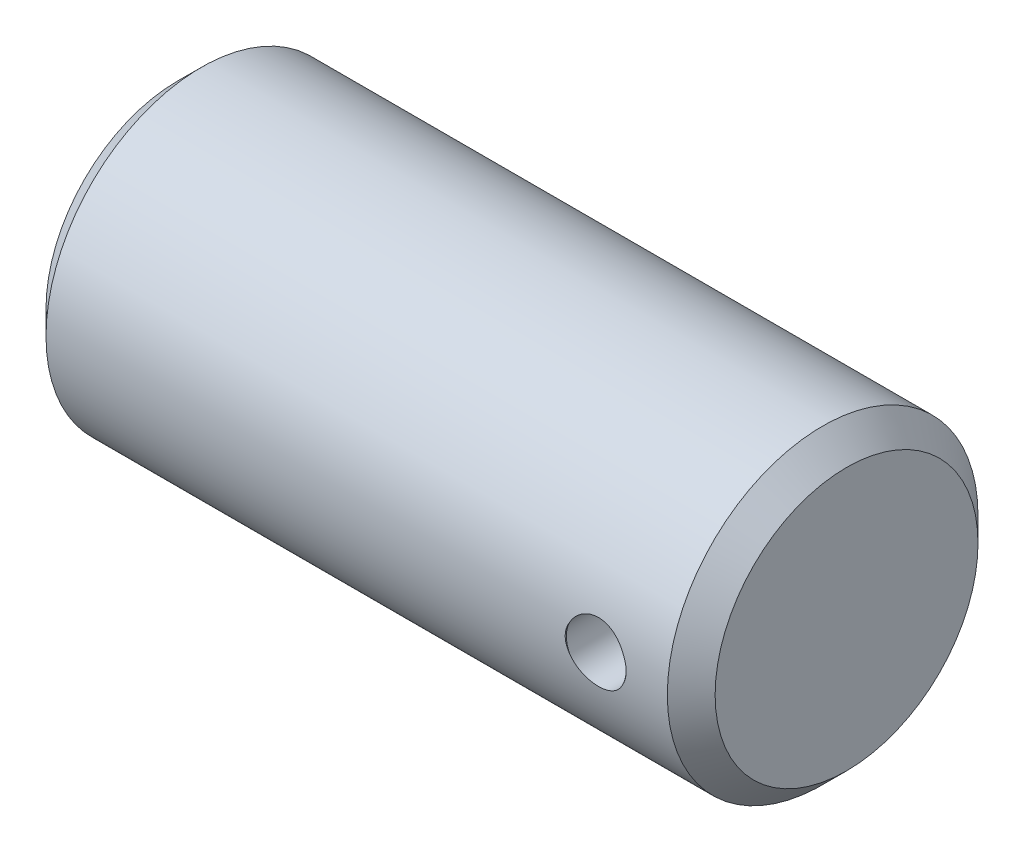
ISO-10303-21;
HEADER;
FILE_DESCRIPTION(('STEP AP214'),'2;1');
FILE_NAME('part.step','',(''),(''),'','','');
FILE_SCHEMA(('AUTOMOTIVE_DESIGN { 1 0 10303 214 1 1 1 1 }'));
ENDSEC;
DATA;
#1=APPLICATION_CONTEXT('core data for automotive mechanical design processes');
#2=APPLICATION_PROTOCOL_DEFINITION('international standard','automotive_design',2000,#1);
#3=PRODUCT_CONTEXT('',#1,'mechanical');
#4=PRODUCT('Part','Part','',(#3));
#5=PRODUCT_RELATED_PRODUCT_CATEGORY('part','',(#4));
#6=PRODUCT_DEFINITION_FORMATION('','',#4);
#7=PRODUCT_DEFINITION_CONTEXT('part definition',#1,'design');
#8=PRODUCT_DEFINITION('design','',#6,#7);
#9=PRODUCT_DEFINITION_SHAPE('','',#8);
#10=(LENGTH_UNIT() NAMED_UNIT(*) SI_UNIT(.MILLI.,.METRE.));
#11=(NAMED_UNIT(*) PLANE_ANGLE_UNIT() SI_UNIT($,.RADIAN.));
#12=(NAMED_UNIT(*) SI_UNIT($,.STERADIAN.) SOLID_ANGLE_UNIT());
#13=UNCERTAINTY_MEASURE_WITH_UNIT(LENGTH_MEASURE(1.E-05),#10,'distance_accuracy_value','');
#14=(GEOMETRIC_REPRESENTATION_CONTEXT(3) GLOBAL_UNCERTAINTY_ASSIGNED_CONTEXT((#13)) GLOBAL_UNIT_ASSIGNED_CONTEXT((#10,
#11,#12)) REPRESENTATION_CONTEXT('',''));
#15=CARTESIAN_POINT('',(0.,0.,0.));
#16=DIRECTION('',(0.,0.,1.));
#17=DIRECTION('',(1.,0.,0.));
#18=AXIS2_PLACEMENT_3D('',#15,#16,#17);
#19=CARTESIAN_POINT('',(0.,0.,0.));
#20=DIRECTION('',(1.,0.,0.));
#21=DIRECTION('',(0.,0.,-1.));
#22=AXIS2_PLACEMENT_3D('',#19,#20,#21);
#23=PLANE('',#22);
#24=CARTESIAN_POINT('',(0.,0.,0.));
#25=DIRECTION('',(1.,0.,0.));
#26=DIRECTION('',(0.,0.,-1.));
#27=AXIS2_PLACEMENT_3D('',#24,#25,#26);
#28=CIRCLE('',#27,5.49999999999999);
#29=CARTESIAN_POINT('',(0.,0.,-5.49999999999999));
#30=VERTEX_POINT('',#29);
#31=EDGE_CURVE('E103',#30,#30,#28,.F.);
#32=ORIENTED_EDGE('',*,*,#31,.T.);
#33=EDGE_LOOP('',(#32));
#34=FACE_BOUND('',#33,.T.);
#35=ADVANCED_FACE('F43',(#34),#23,.F.);
#36=CARTESIAN_POINT('',(0.,0.,0.));
#37=DIRECTION('',(-1.,0.,0.));
#38=DIRECTION('',(0.,0.,1.));
#39=AXIS2_PLACEMENT_3D('',#36,#37,#38);
#40=CYLINDRICAL_SURFACE('',#39,6.5);
#41=CARTESIAN_POINT('',(22.8872893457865,0.56953928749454,6.47500000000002));
#42=CARTESIAN_POINT('',(22.9033806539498,0.600976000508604,6.47223573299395));
#43=CARTESIAN_POINT('',(22.920789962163,0.631702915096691,6.4693012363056));
#44=CARTESIAN_POINT('',(22.9581281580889,0.69155505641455,6.46317680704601));
#45=CARTESIAN_POINT('',(22.978056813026,0.720680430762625,6.4599868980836));
#46=CARTESIAN_POINT('',(23.0413941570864,0.805312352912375,6.45016971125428));
#47=CARTESIAN_POINT('',(23.0883989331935,0.858161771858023,6.44328693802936));
#48=CARTESIAN_POINT('',(23.1906293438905,0.955193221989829,6.42962041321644));
#49=CARTESIAN_POINT('',(23.2458575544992,0.999372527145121,6.42283669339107));
#50=CARTESIAN_POINT('',(23.3630303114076,1.07783883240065,6.41013618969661));
#51=CARTESIAN_POINT('',(23.4249733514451,1.11212804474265,6.40421921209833));
#52=CARTESIAN_POINT('',(23.5537606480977,1.16976059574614,6.39394410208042));
#53=CARTESIAN_POINT('',(23.6205968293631,1.19312151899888,6.38958346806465));
#54=CARTESIAN_POINT('',(23.7573558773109,1.22825353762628,6.38292383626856));
#55=CARTESIAN_POINT('',(23.8272787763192,1.24002451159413,6.3806248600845));
#56=CARTESIAN_POINT('',(23.9669743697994,1.25149502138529,6.37838491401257));
#57=CARTESIAN_POINT('',(24.0367303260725,1.25139150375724,6.37840547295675));
#58=CARTESIAN_POINT('',(24.1752120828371,1.23960837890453,6.38070576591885));
#59=CARTESIAN_POINT('',(24.2439379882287,1.22792995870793,6.38298526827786));
#60=CARTESIAN_POINT('',(24.3779802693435,1.19347827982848,6.3895157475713));
#61=CARTESIAN_POINT('',(24.4433154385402,1.17077556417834,6.39375418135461));
#62=CARTESIAN_POINT('',(24.5692776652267,1.11497490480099,6.40371997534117));
#63=CARTESIAN_POINT('',(24.6299034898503,1.08187425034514,6.40944772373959));
#64=CARTESIAN_POINT('',(24.7456443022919,1.00567677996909,6.4218472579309));
#65=CARTESIAN_POINT('',(24.8006685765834,0.962444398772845,6.42853131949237));
#66=CARTESIAN_POINT('',(24.9027134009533,0.867443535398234,6.44203627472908));
#67=CARTESIAN_POINT('',(24.949740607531,0.815682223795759,6.44885704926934));
#68=CARTESIAN_POINT('',(25.0150526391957,0.73047489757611,6.45889436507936));
#69=CARTESIAN_POINT('',(25.0366254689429,0.699521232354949,6.46232879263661));
#70=CARTESIAN_POINT('',(25.076866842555,0.635825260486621,6.46890663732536));
#71=CARTESIAN_POINT('',(25.0955402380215,0.603086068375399,6.4720505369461));
#72=CARTESIAN_POINT('',(25.1127106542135,0.569539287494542,6.47500000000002));
#73=B_SPLINE_CURVE_WITH_KNOTS('',3,(#41,#42,#43,#44,#45,#46,#47,#48,#49,#50,#51,#52,#53,#54,#55,
#56,#57,#58,#59,#60,#61,#62,#63,#64,#65,#66,#67,#68,#69,#70,#71,#72),.UNSPECIFIED.,.F.,.F.,(4,2,
2,2,2,2,2,2,2,2,2,2,2,2,2,4),(0.,0.106204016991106,0.212398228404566,0.424495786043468,
0.636659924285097,0.848776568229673,1.06055071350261,1.27232707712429,1.4805915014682,
1.6888345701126,1.89576233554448,2.10274409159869,2.3126717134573,2.52242373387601,
2.63594307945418,2.74927037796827),.UNSPECIFIED.);
#74=CARTESIAN_POINT('',(22.8872893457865,0.569539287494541,6.47500000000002));
#75=VERTEX_POINT('',#74);
#76=CARTESIAN_POINT('',(25.1127106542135,0.56953928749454,6.47500000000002));
#77=VERTEX_POINT('',#76);
#78=EDGE_CURVE('E59',#75,#77,#73,.T.);
#79=ORIENTED_EDGE('',*,*,#78,.T.);
#80=CARTESIAN_POINT('',(25.0938119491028,0.5994436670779,6.47230000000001));
#81=CARTESIAN_POINT('',(25.1276633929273,0.547782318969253,6.47710821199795));
#82=CARTESIAN_POINT('',(25.1573062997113,0.493263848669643,6.48151169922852));
#83=CARTESIAN_POINT('',(25.207243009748,0.379963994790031,6.48912718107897));
#84=CARTESIAN_POINT('',(25.2275269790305,0.321178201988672,6.49233792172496));
#85=CARTESIAN_POINT('',(25.2579027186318,0.200257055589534,6.49720040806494));
#86=CARTESIAN_POINT('',(25.2678814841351,0.13809227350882,6.49883485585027));
#87=CARTESIAN_POINT('',(25.2767575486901,0.0130165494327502,6.5002868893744));
#88=CARTESIAN_POINT('',(25.2756668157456,-0.0498935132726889,6.50010643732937));
#89=CARTESIAN_POINT('',(25.2628364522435,-0.171284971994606,6.49801224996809));
#90=CARTESIAN_POINT('',(25.251647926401,-0.229827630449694,6.49618822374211));
#91=CARTESIAN_POINT('',(25.2198736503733,-0.344249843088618,6.49113001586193));
#92=CARTESIAN_POINT('',(25.1992889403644,-0.400129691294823,6.48789599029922));
#93=CARTESIAN_POINT('',(25.1628013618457,-0.479193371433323,6.48236222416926));
#94=CARTESIAN_POINT('',(25.1502118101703,-0.503990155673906,6.48047756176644));
#95=CARTESIAN_POINT('',(25.1232940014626,-0.552517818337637,6.47652019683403));
#96=CARTESIAN_POINT('',(25.1089705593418,-0.57625140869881,6.4744480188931));
#97=CARTESIAN_POINT('',(25.0938119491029,-0.599443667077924,6.47230000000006));
#98=B_SPLINE_CURVE_WITH_KNOTS('',3,(#80,#81,#82,#83,#84,#85,#86,#87,#88,#89,#90,#91,#92,#93,#94,
#95,#96,#97),.UNSPECIFIED.,.F.,.F.,(4,2,2,2,2,2,2,2,4),(0.,0.185732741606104,0.371660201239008,
0.559605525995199,0.747347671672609,0.925424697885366,1.10348201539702,1.18703973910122,
1.27037053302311),.UNSPECIFIED.);
#99=CARTESIAN_POINT('',(25.1127106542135,-0.56953928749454,6.47500000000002));
#100=VERTEX_POINT('',#99);
#101=EDGE_CURVE('E11',#77,#100,#98,.T.);
#102=ORIENTED_EDGE('',*,*,#101,.T.);
#103=CARTESIAN_POINT('',(25.1127106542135,-0.56953928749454,6.47500000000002));
#104=CARTESIAN_POINT('',(25.0966193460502,-0.600976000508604,6.47223573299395));
#105=CARTESIAN_POINT('',(25.079210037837,-0.631702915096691,6.4693012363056));
#106=CARTESIAN_POINT('',(25.0418718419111,-0.69155505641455,6.46317680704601));
#107=CARTESIAN_POINT('',(25.021943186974,-0.720680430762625,6.4599868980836));
#108=CARTESIAN_POINT('',(24.9586058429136,-0.805312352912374,6.45016971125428));
#109=CARTESIAN_POINT('',(24.9116010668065,-0.858161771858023,6.44328693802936));
#110=CARTESIAN_POINT('',(24.8093706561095,-0.955193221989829,6.42962041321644));
#111=CARTESIAN_POINT('',(24.7541424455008,-0.999372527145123,6.42283669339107));
#112=CARTESIAN_POINT('',(24.6369696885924,-1.07783883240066,6.41013618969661));
#113=CARTESIAN_POINT('',(24.5750266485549,-1.11212804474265,6.40421921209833));
#114=CARTESIAN_POINT('',(24.4462393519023,-1.16976059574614,6.39394410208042));
#115=CARTESIAN_POINT('',(24.3794031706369,-1.19312151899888,6.38958346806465));
#116=CARTESIAN_POINT('',(24.2426441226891,-1.22825353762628,6.38292383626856));
#117=CARTESIAN_POINT('',(24.1727212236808,-1.24002451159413,6.3806248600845));
#118=CARTESIAN_POINT('',(24.0330256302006,-1.25149502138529,6.37838491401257));
#119=CARTESIAN_POINT('',(23.9632696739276,-1.25139150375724,6.37840547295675));
#120=CARTESIAN_POINT('',(23.8247879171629,-1.23960837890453,6.38070576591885));
#121=CARTESIAN_POINT('',(23.7560620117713,-1.22792995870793,6.38298526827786));
#122=CARTESIAN_POINT('',(23.6220197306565,-1.19347827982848,6.3895157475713));
#123=CARTESIAN_POINT('',(23.5566845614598,-1.17077556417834,6.39375418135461));
#124=CARTESIAN_POINT('',(23.4307223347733,-1.11497490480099,6.40371997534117));
#125=CARTESIAN_POINT('',(23.3700965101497,-1.08187425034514,6.40944772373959));
#126=CARTESIAN_POINT('',(23.2543556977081,-1.00567677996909,6.4218472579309));
#127=CARTESIAN_POINT('',(23.1993314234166,-0.962444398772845,6.42853131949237));
#128=CARTESIAN_POINT('',(23.0972865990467,-0.867443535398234,6.44203627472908));
#129=CARTESIAN_POINT('',(23.050259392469,-0.815682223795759,6.44885704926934));
#130=CARTESIAN_POINT('',(22.9849473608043,-0.730474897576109,6.45889436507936));
#131=CARTESIAN_POINT('',(22.9633745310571,-0.699521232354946,6.46232879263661));
#132=CARTESIAN_POINT('',(22.923133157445,-0.635825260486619,6.46890663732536));
#133=CARTESIAN_POINT('',(22.9044597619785,-0.603086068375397,6.4720505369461));
#134=CARTESIAN_POINT('',(22.8872893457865,-0.569539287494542,6.47500000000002));
#135=B_SPLINE_CURVE_WITH_KNOTS('',3,(#103,#104,#105,#106,#107,#108,#109,#110,#111,#112,#113,
#114,#115,#116,#117,#118,#119,#120,#121,#122,#123,#124,#125,#126,#127,#128,#129,#130,#131,#132,
#133,#134),.UNSPECIFIED.,.F.,.F.,(4,2,2,2,2,2,2,2,2,2,2,2,2,2,2,4),(0.,0.106204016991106,
0.212398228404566,0.424495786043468,0.636659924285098,0.848776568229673,1.06055071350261,
1.27232707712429,1.4805915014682,1.6888345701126,1.89576233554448,2.10274409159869,
2.3126717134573,2.52242373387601,2.63594307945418,2.74927037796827),.UNSPECIFIED.);
#136=CARTESIAN_POINT('',(22.8872893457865,-0.56953928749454,6.47500000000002));
#137=VERTEX_POINT('',#136);
#138=EDGE_CURVE('E72',#100,#137,#135,.T.);
#139=ORIENTED_EDGE('',*,*,#138,.T.);
#140=CARTESIAN_POINT('',(22.906188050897,-0.599443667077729,6.47230000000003));
#141=CARTESIAN_POINT('',(22.8723366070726,-0.547782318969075,6.47710821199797));
#142=CARTESIAN_POINT('',(22.8426937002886,-0.493263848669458,6.48151169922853));
#143=CARTESIAN_POINT('',(22.7927569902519,-0.379963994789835,6.48912718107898));
#144=CARTESIAN_POINT('',(22.7724730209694,-0.321178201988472,6.49233792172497));
#145=CARTESIAN_POINT('',(22.7420972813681,-0.20025705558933,6.49720040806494));
#146=CARTESIAN_POINT('',(22.7321185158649,-0.138092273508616,6.49883485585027));
#147=CARTESIAN_POINT('',(22.7232424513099,-0.0130165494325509,6.5002868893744));
#148=CARTESIAN_POINT('',(22.7243331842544,0.0498935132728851,6.50010643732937));
#149=CARTESIAN_POINT('',(22.7371635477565,0.171284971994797,6.49801224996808));
#150=CARTESIAN_POINT('',(22.748352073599,0.229827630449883,6.49618822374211));
#151=CARTESIAN_POINT('',(22.7801263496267,0.344249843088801,6.49113001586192));
#152=CARTESIAN_POINT('',(22.8007110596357,0.400129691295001,6.48789599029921));
#153=CARTESIAN_POINT('',(22.8371986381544,0.479193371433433,6.48236222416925));
#154=CARTESIAN_POINT('',(22.8497881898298,0.503990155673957,6.48047756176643));
#155=CARTESIAN_POINT('',(22.8767059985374,0.552517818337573,6.47652019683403));
#156=CARTESIAN_POINT('',(22.8910294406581,0.576251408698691,6.47444801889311));
#157=CARTESIAN_POINT('',(22.906188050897,0.599443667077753,6.47230000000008));
#158=B_SPLINE_CURVE_WITH_KNOTS('',3,(#140,#141,#142,#143,#144,#145,#146,#147,#148,#149,#150,
#151,#152,#153,#154,#155,#156,#157),.UNSPECIFIED.,.F.,.F.,(4,2,2,2,2,2,2,2,4),(0.,
0.185732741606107,0.371660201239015,0.559605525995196,0.747347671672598,0.925424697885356,
1.10348201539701,1.18703973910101,1.2703705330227),.UNSPECIFIED.);
#159=EDGE_CURVE('E106',#137,#75,#158,.T.);
#160=ORIENTED_EDGE('',*,*,#159,.T.);
#161=EDGE_LOOP('',(#79,#102,#139,#160));
#162=FACE_BOUND('',#161,.T.);
#163=CARTESIAN_POINT('',(27.,0.,0.));
#164=DIRECTION('',(-1.,0.,0.));
#165=DIRECTION('',(0.,0.,1.));
#166=AXIS2_PLACEMENT_3D('',#163,#164,#165);
#167=CIRCLE('',#166,6.5);
#168=CARTESIAN_POINT('',(27.,0.,6.5));
#169=VERTEX_POINT('',#168);
#170=EDGE_CURVE('E91',#169,#169,#167,.T.);
#171=ORIENTED_EDGE('',*,*,#170,.T.);
#172=EDGE_LOOP('',(#171));
#173=FACE_BOUND('',#172,.T.);
#174=CARTESIAN_POINT('',(1.00000000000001,0.,0.));
#175=DIRECTION('',(1.,0.,0.));
#176=DIRECTION('',(0.,0.,-1.));
#177=AXIS2_PLACEMENT_3D('',#174,#175,#176);
#178=CIRCLE('',#177,6.5);
#179=CARTESIAN_POINT('',(1.00000000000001,0.,-6.5));
#180=VERTEX_POINT('',#179);
#181=EDGE_CURVE('E89',#180,#180,#178,.T.);
#182=ORIENTED_EDGE('',*,*,#181,.T.);
#183=EDGE_LOOP('',(#182));
#184=FACE_BOUND('',#183,.T.);
#185=ADVANCED_FACE('F119',(#162,#173,#184),#40,.T.);
#186=CARTESIAN_POINT('',(28.,0.,0.));
#187=DIRECTION('',(-1.,0.,0.));
#188=DIRECTION('',(0.,0.,1.));
#189=AXIS2_PLACEMENT_3D('',#186,#187,#188);
#190=PLANE('',#189);
#191=CARTESIAN_POINT('',(28.,0.,0.));
#192=DIRECTION('',(-1.,0.,0.));
#193=DIRECTION('',(0.,0.,1.));
#194=AXIS2_PLACEMENT_3D('',#191,#192,#193);
#195=CIRCLE('',#194,5.49999999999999);
#196=CARTESIAN_POINT('',(28.,0.,5.49999999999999));
#197=VERTEX_POINT('',#196);
#198=EDGE_CURVE('E99',#197,#197,#195,.F.);
#199=ORIENTED_EDGE('',*,*,#198,.T.);
#200=EDGE_LOOP('',(#199));
#201=FACE_BOUND('',#200,.T.);
#202=ADVANCED_FACE('F150',(#201),#190,.F.);
#203=CARTESIAN_POINT('',(27.,0.,0.));
#204=DIRECTION('',(-1.,0.,0.));
#205=DIRECTION('',(0.,0.,1.));
#206=AXIS2_PLACEMENT_3D('',#203,#204,#205);
#207=CONICAL_SURFACE('',#206,6.5,0.785398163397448);
#208=ORIENTED_EDGE('',*,*,#198,.F.);
#209=EDGE_LOOP('',(#208));
#210=FACE_BOUND('',#209,.T.);
#211=ORIENTED_EDGE('',*,*,#170,.F.);
#212=EDGE_LOOP('',(#211));
#213=FACE_BOUND('',#212,.T.);
#214=ADVANCED_FACE('F149',(#210,#213),#207,.T.);
#215=CARTESIAN_POINT('',(0.,0.,0.));
#216=DIRECTION('',(1.,0.,0.));
#217=DIRECTION('',(0.,0.,-1.));
#218=AXIS2_PLACEMENT_3D('',#215,#216,#217);
#219=CONICAL_SURFACE('',#218,5.49999999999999,0.785398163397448);
#220=ORIENTED_EDGE('',*,*,#181,.F.);
#221=EDGE_LOOP('',(#220));
#222=FACE_BOUND('',#221,.T.);
#223=ORIENTED_EDGE('',*,*,#31,.F.);
#224=EDGE_LOOP('',(#223));
#225=FACE_BOUND('',#224,.T.);
#226=ADVANCED_FACE('F46',(#222,#225),#219,.T.);
#227=CARTESIAN_POINT('',(24.,0.,6.5));
#228=DIRECTION('',(0.,0.,1.));
#229=DIRECTION('',(1.,0.,0.));
#230=AXIS2_PLACEMENT_3D('',#227,#228,#229);
#231=CYLINDRICAL_SURFACE('',#230,1.24999999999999);
#232=CARTESIAN_POINT('',(24.,0.,3.5));
#233=DIRECTION('',(0.,0.,1.));
#234=DIRECTION('',(1.,0.,0.));
#235=AXIS2_PLACEMENT_3D('',#232,#233,#234);
#236=CIRCLE('',#235,1.24999999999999);
#237=CARTESIAN_POINT('',(25.25,0.,3.5));
#238=VERTEX_POINT('',#237);
#239=EDGE_CURVE('E86',#238,#238,#236,.T.);
#240=ORIENTED_EDGE('',*,*,#239,.F.);
#241=EDGE_LOOP('',(#240));
#242=FACE_BOUND('',#241,.T.);
#243=CARTESIAN_POINT('',(24.,0.,6.47500000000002));
#244=DIRECTION('',(0.,0.,1.));
#245=DIRECTION('',(1.,0.,0.));
#246=AXIS2_PLACEMENT_3D('',#243,#244,#245);
#247=CIRCLE('',#246,1.24999999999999);
#248=EDGE_CURVE('E63',#75,#137,#247,.T.);
#249=ORIENTED_EDGE('',*,*,#248,.T.);
#250=ORIENTED_EDGE('',*,*,#138,.F.);
#251=EDGE_CURVE('E92',#100,#77,#247,.T.);
#252=ORIENTED_EDGE('',*,*,#251,.T.);
#253=ORIENTED_EDGE('',*,*,#78,.F.);
#254=EDGE_LOOP('',(#249,#250,#252,#253));
#255=FACE_BOUND('',#254,.T.);
#256=ADVANCED_FACE('F122',(#242,#255),#231,.F.);
#257=CARTESIAN_POINT('',(24.,0.,6.5));
#258=DIRECTION('',(0.,0.,1.));
#259=DIRECTION('',(1.,0.,0.));
#260=AXIS2_PLACEMENT_3D('',#257,#258,#259);
#261=CONICAL_SURFACE('',#260,1.275,0.785398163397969);
#262=ORIENTED_EDGE('',*,*,#251,.F.);
#263=ORIENTED_EDGE('',*,*,#101,.F.);
#264=EDGE_LOOP('',(#262,#263));
#265=FACE_BOUND('',#264,.T.);
#266=ADVANCED_FACE('F121',(#265),#261,.F.);
#267=ORIENTED_EDGE('',*,*,#248,.F.);
#268=ORIENTED_EDGE('',*,*,#159,.F.);
#269=EDGE_LOOP('',(#267,#268));
#270=FACE_BOUND('',#269,.T.);
#271=ADVANCED_FACE('F83',(#270),#261,.F.);
#272=CARTESIAN_POINT('',(24.,0.,3.5));
#273=DIRECTION('',(0.,0.,1.));
#274=DIRECTION('',(1.,0.,0.));
#275=AXIS2_PLACEMENT_3D('',#272,#273,#274);
#276=CONICAL_SURFACE('',#275,1.24999999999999,1.02974425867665);
#277=CARTESIAN_POINT('',(24.,0.,2.74892422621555));
#278=VERTEX_POINT('',#277);
#279=VERTEX_LOOP('',#278);
#280=FACE_BOUND('',#279,.T.);
#281=ORIENTED_EDGE('',*,*,#239,.T.);
#282=EDGE_LOOP('',(#281));
#283=FACE_BOUND('',#282,.T.);
#284=ADVANCED_FACE('F84',(#280,#283),#276,.F.);
#285=CLOSED_SHELL('',(#35,#185,#202,#214,#226,#256,#266,#271,#284));
#286=MANIFOLD_SOLID_BREP('B2',#285);
#287=ADVANCED_BREP_SHAPE_REPRESENTATION('',(#18,#286),#14);
#288=SHAPE_DEFINITION_REPRESENTATION(#9,#287);
ENDSEC;
END-ISO-10303-21;
